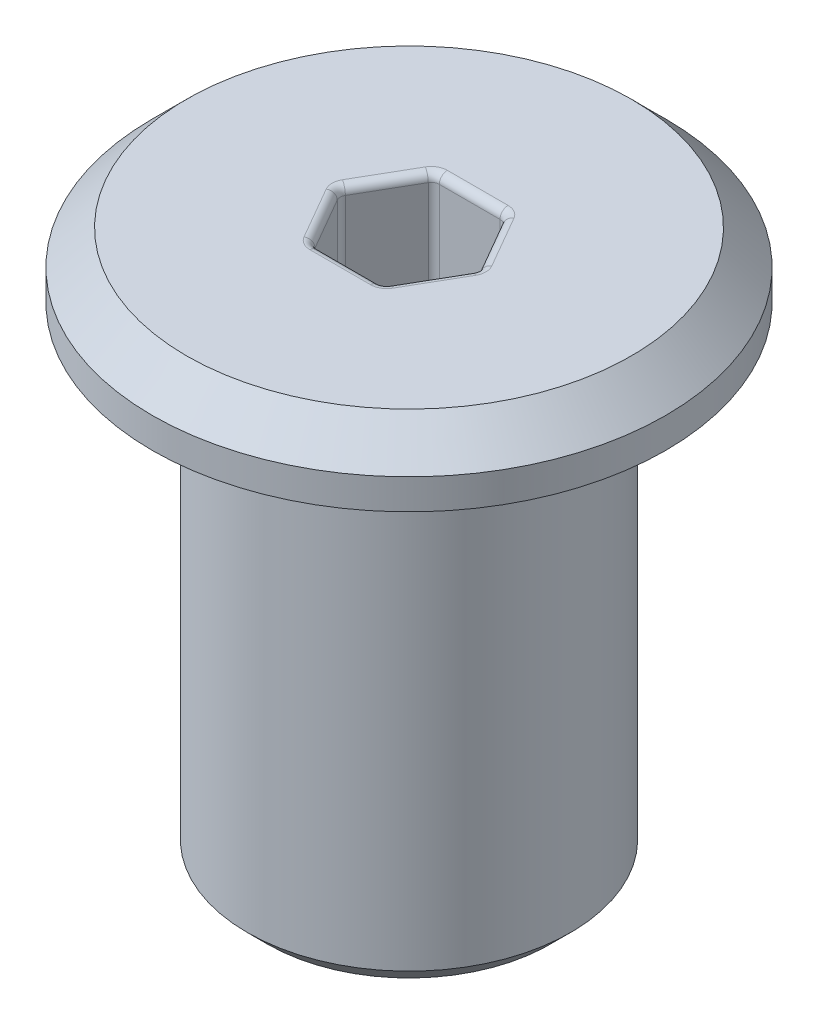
from build123d import *

# Parameters (mm, degrees)
CHC_DEPTH = 5
CONG_1_R  = 0.2


with BuildPart() as part:
    # Esquisse1 → Vis (revolve)
    with BuildSketch(Plane.XY, mode=Mode.PRIVATE) as vis_sk:
        Polygon((-6.35, 0), (-4, 0), (-4, -11.5), (-3.5, -12), (0, -12), (0, 1.6), (-5.5, 1.6), (-6.35, 0.75), align=None)
    revolve(vis_sk.sketch.rotate(Axis((0, 4.5, 0), (0, -1, 0)), 270), axis=Axis((0, 4.5, 0), (0, -1, 0)))

    # Esquisse2 → CHC (cut)
    with BuildSketch(Plane(origin=(0, 1.6, 0), x_dir=(-1, 0, 0), z_dir=(0, 1, 0))):
        Polygon((0.866025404, -1.5), (-0.866025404, -1.5), (-1.732050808, 0), (-0.866025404, 1.5), (0.866025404, 1.5), (1.732050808, 0), align=None)
    extrude(amount=-CHC_DEPTH, mode=Mode.SUBTRACT)

    # Cong_1
    cong_1_edges = [part.edges().sort_by_distance(p)[0] for p in [
        (-1.299038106, 1.6, -0.75),
        (-1.299038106, 1.6, 0.75),
        (0, 1.6, 1.5),
        (1.299038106, 1.6, 0.75),
        (1.299038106, 1.6, -0.75),
        (0, 1.6, -1.5),
        (-1.732050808, -0.9, 0),
        (-0.866025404, -0.9, -1.5),
        (-1.299038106, -3.4, -0.75),
        (-0.866025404, -0.9, 1.5),
        (-1.299038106, -3.4, 0.75),
        (0.866025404, -0.9, 1.5),
        (0, -3.4, 1.5),
        (1.732050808, -0.9, 0),
        (1.299038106, -3.4, 0.75),
        (0.866025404, -0.9, -1.5),
        (1.299038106, -3.4, -0.75),
        (0, -3.4, -1.5),
    ]]
    fillet(cong_1_edges, radius=CONG_1_R)


solid = part.part
